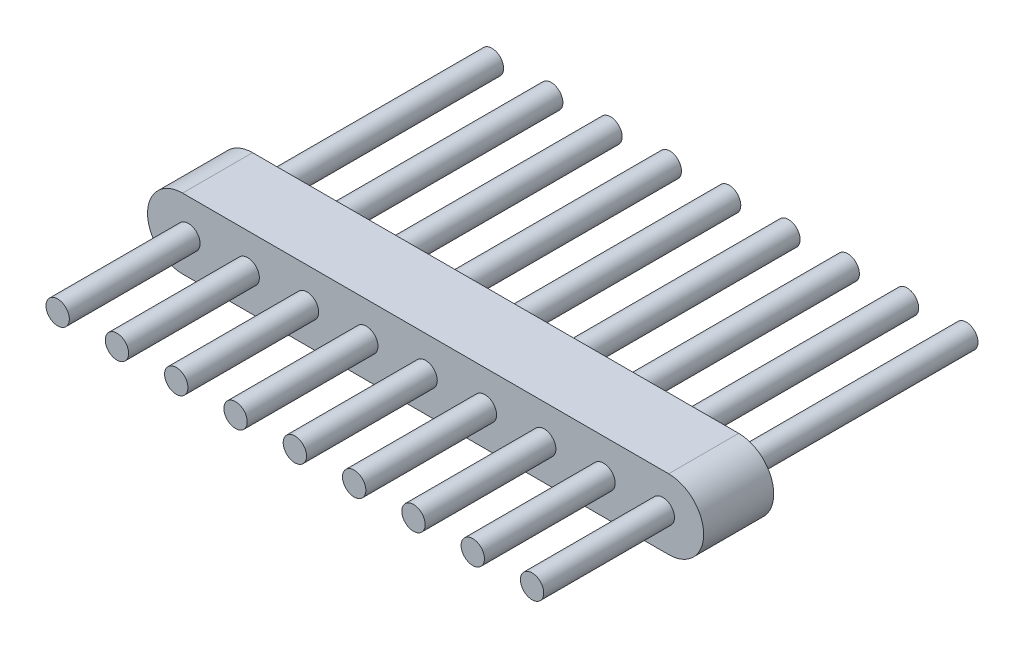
from build123d import *

# Parameters (mm, degrees)
EXTRUDE_1_DEPTH = 1.5
SKETCH_3_R      = 0.25
EXTRUDE_2_DEPTH = 2.8
EXTRUDE_START   = 5
SKETCH_4_R      = 0.25
EXTRUDE_3_DEPTH = 5


with BuildPart() as part:
    # Sketch 2 → Extrude 1 (new body)
    with BuildSketch(Plane.XY):
        with BuildLine():
            Line((125.878875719, 143.8005185), (136.288875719, 143.8005185))
            ThreePointArc((136.288875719, 143.8005185), (137.038875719, 143.0505185), (136.288875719, 142.3005185))
            Line((136.288875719, 142.3005185), (125.878875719, 142.3005185))
            ThreePointArc((125.878875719, 142.3005185), (125.128875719, 143.0505185), (125.878875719, 143.8005185))
        make_face()
    extrude(amount=EXTRUDE_1_DEPTH)

    # Sketch 3 → Extrude 2 (add)
    with BuildSketch(Plane.XY.offset(1.5)):
        with Locations((126.003875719, 143.0505185)):
            Circle(SKETCH_3_R)
        with Locations((127.273875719, 143.0505185)):
            Circle(SKETCH_3_R)
        with Locations((128.543875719, 143.0505185)):
            Circle(SKETCH_3_R)
        with Locations((129.813875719, 143.0505185)):
            Circle(SKETCH_3_R)
        with Locations((131.083875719, 143.0505185)):
            Circle(SKETCH_3_R)
        with Locations((132.353875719, 143.0505185)):
            Circle(SKETCH_3_R)
        with Locations((133.623875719, 143.0505185)):
            Circle(SKETCH_3_R)
        with Locations((134.893875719, 143.0505185)):
            Circle(SKETCH_3_R)
        with Locations((136.163875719, 143.0505185)):
            Circle(SKETCH_3_R)
    extrude(amount=EXTRUDE_2_DEPTH)

    # Sketch 4 → Extrude 3 (add)
    with BuildSketch(Plane(origin=(0, 0, 0), x_dir=(-1, 0, 0), z_dir=(0, 0, -1)).offset(EXTRUDE_START)):
        with Locations(Location((-136.163875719, 143.0505185, 0), (0, 0, 180))):
            Circle(SKETCH_4_R)
        with Locations(Location((-134.893875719, 143.0505185, 0), (0, 0, 180))):
            Circle(SKETCH_4_R)
        with Locations(Location((-133.623875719, 143.0505185, 0), (0, 0, 180))):
            Circle(SKETCH_4_R)
        with Locations(Location((-132.353875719, 143.0505185, 0), (0, 0, 180))):
            Circle(SKETCH_4_R)
        with Locations(Location((-131.083875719, 143.0505185, 0), (0, 0, 180))):
            Circle(SKETCH_4_R)
        with Locations(Location((-129.813875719, 143.0505185, 0), (0, 0, 180))):
            Circle(SKETCH_4_R)
        with Locations(Location((-128.543875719, 143.0505185, 0), (0, 0, 180))):
            Circle(SKETCH_4_R)
        with Locations(Location((-127.273875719, 143.0505185, 0), (0, 0, 180))):
            Circle(SKETCH_4_R)
        with Locations(Location((-126.003875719, 143.0505185, 0), (0, 0, 180))):
            Circle(SKETCH_4_R)
    extrude(amount=-EXTRUDE_3_DEPTH)


solid = part.part
